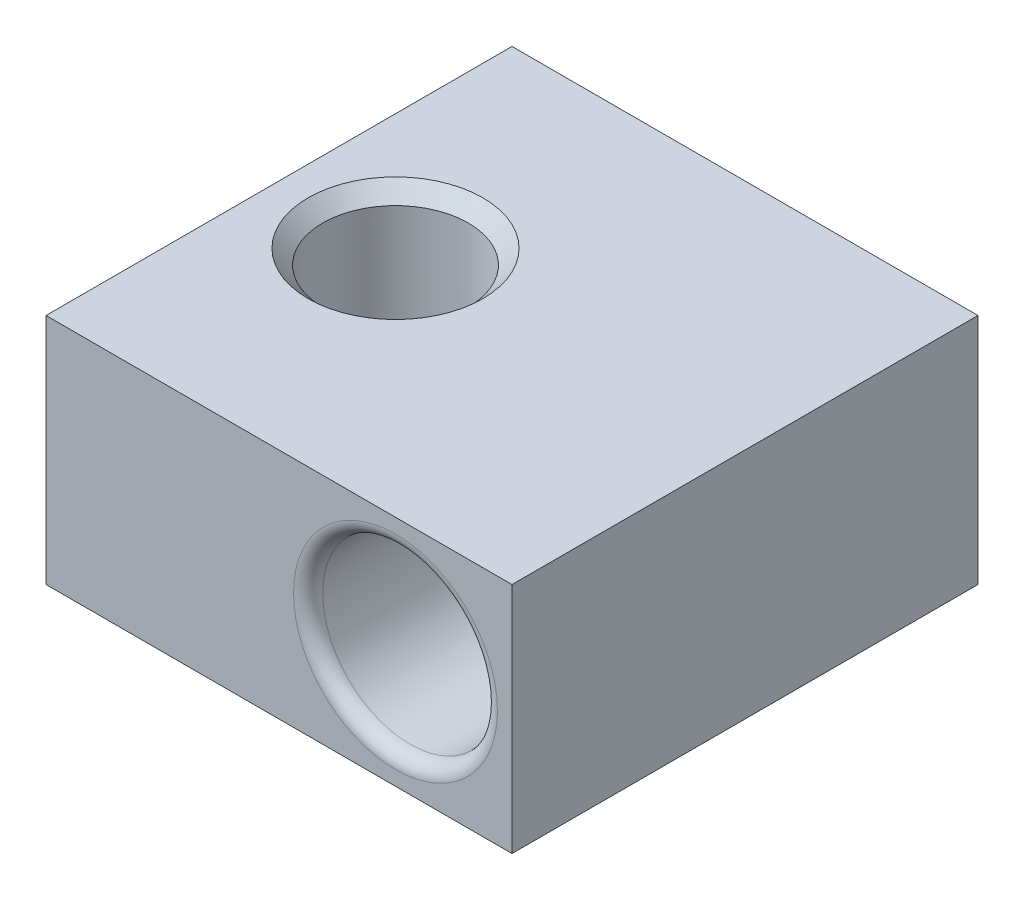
from build123d import *

# Parameters (mm, degrees)
ESQUISSE1_W             = 16
ESQUISSE1_H             = 8
ESQUISSE1_R             = 3
BOSS_EXTRU_1_DEPTH      = 16
ESQUISSE2_R             = 2.5
ENL_V_MAT_EXTRU_1_DEPTH = 25
CHANFREIN1_SIZE         = 0.5
CONG_1_R                = 0.5


with BuildPart() as part:
    # Esquisse1 → Boss.-Extru.1 (new body)
    with BuildSketch(Plane.XY):
        with Locations((8, 4)):
            Rectangle(ESQUISSE1_W, ESQUISSE1_H)
        with Locations((12, 4)):
            Circle(ESQUISSE1_R, mode=Mode.SUBTRACT)
    extrude(amount=BOSS_EXTRU_1_DEPTH)

    # Esquisse2 → Enl_v. mat.-Extru.1 (cut, through all)
    with BuildSketch(Plane(origin=(0, 8, 0), x_dir=(1, 0, 0), z_dir=(0, 1, 0))):
        with Locations(Location((4, -8, 0), (0, 0, 270))):
            Circle(ESQUISSE2_R)
    extrude(amount=-ENL_V_MAT_EXTRU_1_DEPTH, mode=Mode.SUBTRACT)

    # Chanfrein1
    chanfrein1_edges = [part.edges().sort_by_distance(p)[0] for p in [
        (4, 0, 5.5),
        (4, 8, 5.5),
    ]]
    chamfer(chanfrein1_edges, length=CHANFREIN1_SIZE)

    # Cong_1
    cong_1_edges = [part.edges().sort_by_distance(p)[0] for p in [
        (9, 4, 0),
        (9, 4, 16),
    ]]
    fillet(cong_1_edges, radius=CONG_1_R)


solid = part.part
